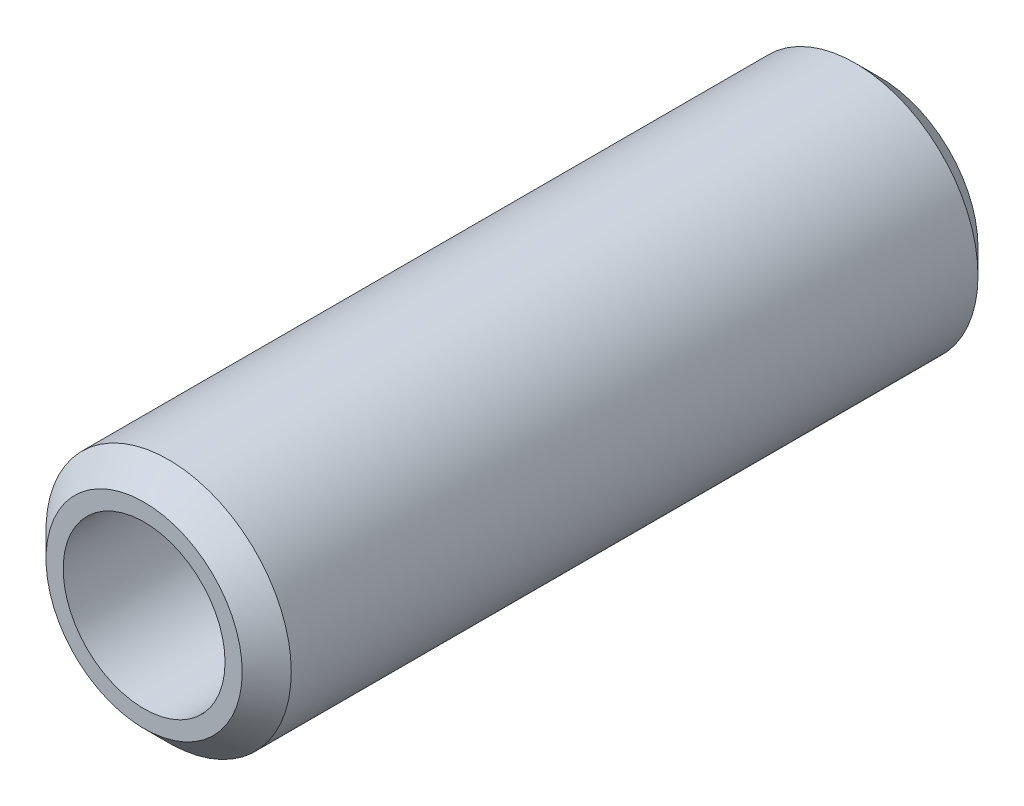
ISO-10303-21;
HEADER;
FILE_DESCRIPTION(('STEP AP214'),'2;1');
FILE_NAME('part.step','',(''),(''),'','','');
FILE_SCHEMA(('AUTOMOTIVE_DESIGN { 1 0 10303 214 1 1 1 1 }'));
ENDSEC;
DATA;
#1=APPLICATION_CONTEXT('core data for automotive mechanical design processes');
#2=APPLICATION_PROTOCOL_DEFINITION('international standard','automotive_design',2000,#1);
#3=PRODUCT_CONTEXT('',#1,'mechanical');
#4=PRODUCT('Part','Part','',(#3));
#5=PRODUCT_RELATED_PRODUCT_CATEGORY('part','',(#4));
#6=PRODUCT_DEFINITION_FORMATION('','',#4);
#7=PRODUCT_DEFINITION_CONTEXT('part definition',#1,'design');
#8=PRODUCT_DEFINITION('design','',#6,#7);
#9=PRODUCT_DEFINITION_SHAPE('','',#8);
#10=(LENGTH_UNIT() NAMED_UNIT(*) SI_UNIT(.MILLI.,.METRE.));
#11=(NAMED_UNIT(*) PLANE_ANGLE_UNIT() SI_UNIT($,.RADIAN.));
#12=(NAMED_UNIT(*) SI_UNIT($,.STERADIAN.) SOLID_ANGLE_UNIT());
#13=UNCERTAINTY_MEASURE_WITH_UNIT(LENGTH_MEASURE(1.E-05),#10,'distance_accuracy_value','');
#14=(GEOMETRIC_REPRESENTATION_CONTEXT(3) GLOBAL_UNCERTAINTY_ASSIGNED_CONTEXT((#13)) GLOBAL_UNIT_ASSIGNED_CONTEXT((#10,
#11,#12)) REPRESENTATION_CONTEXT('',''));
#15=CARTESIAN_POINT('',(0.,0.,0.));
#16=DIRECTION('',(0.,0.,1.));
#17=DIRECTION('',(1.,0.,0.));
#18=AXIS2_PLACEMENT_3D('',#15,#16,#17);
#19=CARTESIAN_POINT('',(0.,0.,15.));
#20=DIRECTION('',(0.,0.,-1.));
#21=DIRECTION('',(-1.,0.,0.));
#22=AXIS2_PLACEMENT_3D('',#19,#20,#21);
#23=CYLINDRICAL_SURFACE('',#22,2.5);
#24=CARTESIAN_POINT('',(0.,0.,0.499999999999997));
#25=DIRECTION('',(0.,0.,1.));
#26=DIRECTION('',(1.,0.,0.));
#27=AXIS2_PLACEMENT_3D('',#24,#25,#26);
#28=CIRCLE('',#27,2.5);
#29=CARTESIAN_POINT('',(2.5,0.,0.499999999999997));
#30=VERTEX_POINT('',#29);
#31=EDGE_CURVE('E46',#30,#30,#28,.T.);
#32=ORIENTED_EDGE('',*,*,#31,.T.);
#33=EDGE_LOOP('',(#32));
#34=FACE_BOUND('',#33,.T.);
#35=CARTESIAN_POINT('',(0.,0.,14.5));
#36=DIRECTION('',(0.,0.,1.));
#37=DIRECTION('',(1.,0.,0.));
#38=AXIS2_PLACEMENT_3D('',#35,#36,#37);
#39=CIRCLE('',#38,2.5);
#40=CARTESIAN_POINT('',(2.5,0.,14.5));
#41=VERTEX_POINT('',#40);
#42=EDGE_CURVE('E50',#41,#41,#39,.F.);
#43=ORIENTED_EDGE('',*,*,#42,.T.);
#44=EDGE_LOOP('',(#43));
#45=FACE_BOUND('',#44,.T.);
#46=ADVANCED_FACE('F36',(#34,#45),#23,.T.);
#47=CARTESIAN_POINT('',(0.,0.,15.));
#48=DIRECTION('',(0.,0.,1.));
#49=DIRECTION('',(1.,0.,0.));
#50=AXIS2_PLACEMENT_3D('',#47,#48,#49);
#51=PLANE('',#50);
#52=CARTESIAN_POINT('',(0.,0.,15.));
#53=DIRECTION('',(0.,0.,1.));
#54=DIRECTION('',(1.,0.,0.));
#55=AXIS2_PLACEMENT_3D('',#52,#53,#54);
#56=CIRCLE('',#55,1.64999999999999);
#57=CARTESIAN_POINT('',(1.64999999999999,0.,15.));
#58=VERTEX_POINT('',#57);
#59=EDGE_CURVE('E55',#58,#58,#56,.T.);
#60=ORIENTED_EDGE('',*,*,#59,.F.);
#61=EDGE_LOOP('',(#60));
#62=FACE_BOUND('',#61,.T.);
#63=CARTESIAN_POINT('',(0.,0.,15.));
#64=DIRECTION('',(0.,0.,1.));
#65=DIRECTION('',(1.,0.,0.));
#66=AXIS2_PLACEMENT_3D('',#63,#64,#65);
#67=CIRCLE('',#66,2.);
#68=CARTESIAN_POINT('',(2.,0.,15.));
#69=VERTEX_POINT('',#68);
#70=EDGE_CURVE('E10',#69,#69,#67,.T.);
#71=ORIENTED_EDGE('',*,*,#70,.T.);
#72=EDGE_LOOP('',(#71));
#73=FACE_BOUND('',#72,.T.);
#74=ADVANCED_FACE('F71',(#62,#73),#51,.T.);
#75=CARTESIAN_POINT('',(0.,0.,0.));
#76=DIRECTION('',(0.,0.,1.));
#77=DIRECTION('',(1.,0.,0.));
#78=AXIS2_PLACEMENT_3D('',#75,#76,#77);
#79=PLANE('',#78);
#80=CARTESIAN_POINT('',(0.,0.,0.));
#81=DIRECTION('',(0.,0.,1.));
#82=DIRECTION('',(1.,0.,0.));
#83=AXIS2_PLACEMENT_3D('',#80,#81,#82);
#84=CIRCLE('',#83,1.65);
#85=CARTESIAN_POINT('',(1.65,0.,0.));
#86=VERTEX_POINT('',#85);
#87=EDGE_CURVE('E58',#86,#86,#84,.T.);
#88=ORIENTED_EDGE('',*,*,#87,.T.);
#89=EDGE_LOOP('',(#88));
#90=FACE_BOUND('',#89,.T.);
#91=CARTESIAN_POINT('',(0.,0.,0.));
#92=DIRECTION('',(0.,0.,1.));
#93=DIRECTION('',(1.,0.,0.));
#94=AXIS2_PLACEMENT_3D('',#91,#92,#93);
#95=CIRCLE('',#94,2.);
#96=CARTESIAN_POINT('',(2.,0.,0.));
#97=VERTEX_POINT('',#96);
#98=EDGE_CURVE('E42',#97,#97,#95,.F.);
#99=ORIENTED_EDGE('',*,*,#98,.T.);
#100=EDGE_LOOP('',(#99));
#101=FACE_BOUND('',#100,.T.);
#102=ADVANCED_FACE('F62',(#90,#101),#79,.F.);
#103=CARTESIAN_POINT('',(0.,0.,0.499999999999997));
#104=DIRECTION('',(0.,0.,1.));
#105=DIRECTION('',(1.,0.,0.));
#106=AXIS2_PLACEMENT_3D('',#103,#104,#105);
#107=CONICAL_SURFACE('',#106,2.5,0.78539816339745);
#108=ORIENTED_EDGE('',*,*,#98,.F.);
#109=EDGE_LOOP('',(#108));
#110=FACE_BOUND('',#109,.T.);
#111=ORIENTED_EDGE('',*,*,#31,.F.);
#112=EDGE_LOOP('',(#111));
#113=FACE_BOUND('',#112,.T.);
#114=ADVANCED_FACE('F77',(#110,#113),#107,.T.);
#115=CARTESIAN_POINT('',(0.,0.,15.));
#116=DIRECTION('',(0.,0.,-1.));
#117=DIRECTION('',(-1.,0.,0.));
#118=AXIS2_PLACEMENT_3D('',#115,#116,#117);
#119=CONICAL_SURFACE('',#118,2.,0.785398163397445);
#120=ORIENTED_EDGE('',*,*,#42,.F.);
#121=EDGE_LOOP('',(#120));
#122=FACE_BOUND('',#121,.T.);
#123=ORIENTED_EDGE('',*,*,#70,.F.);
#124=EDGE_LOOP('',(#123));
#125=FACE_BOUND('',#124,.T.);
#126=ADVANCED_FACE('F67',(#122,#125),#119,.T.);
#127=CARTESIAN_POINT('',(0.,0.,15.));
#128=DIRECTION('',(0.,0.,1.));
#129=DIRECTION('',(1.,0.,0.));
#130=AXIS2_PLACEMENT_3D('',#127,#128,#129);
#131=CYLINDRICAL_SURFACE('',#130,1.64999999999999);
#132=ORIENTED_EDGE('',*,*,#87,.F.);
#133=EDGE_LOOP('',(#132));
#134=FACE_BOUND('',#133,.T.);
#135=ORIENTED_EDGE('',*,*,#59,.T.);
#136=EDGE_LOOP('',(#135));
#137=FACE_BOUND('',#136,.T.);
#138=ADVANCED_FACE('F64',(#134,#137),#131,.F.);
#139=CLOSED_SHELL('',(#46,#74,#102,#114,#126,#138));
#140=MANIFOLD_SOLID_BREP('B2',#139);
#141=ADVANCED_BREP_SHAPE_REPRESENTATION('',(#18,#140),#14);
#142=SHAPE_DEFINITION_REPRESENTATION(#9,#141);
ENDSEC;
END-ISO-10303-21;
